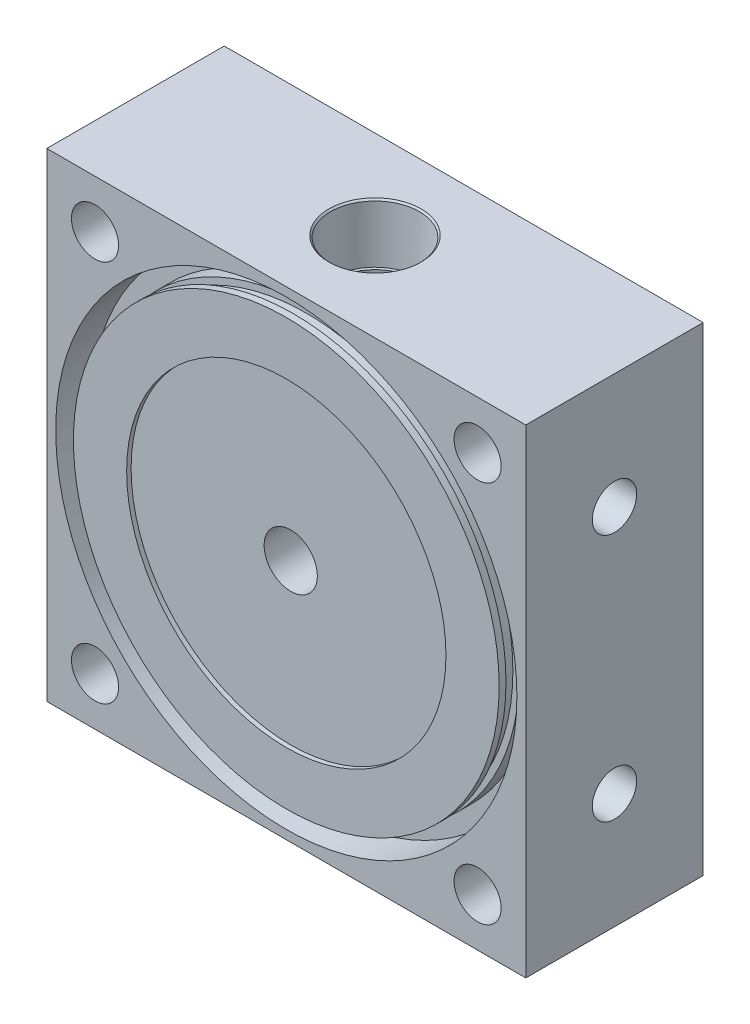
from build123d import *

# Parameters (mm, degrees)
SKETCH1_W                        = 85.725
SKETCH1_H                        = 85.725
EXTRUDE1_DEPTH                   = 31.75
SKETCH2_R                        = 41.275
SKETCH2_R_2                      = 38.1
CUT_EXTRUDE1_DEPTH               = 6.35
F_5_16_CLEARANCE_HOLE1_D         = 8.4328
F_3_8_0_375_DIAMETER_HOLE1_D     = 9.525
F_3_8_0_375_DIAMETER_HOLE1_DEPTH = 15.875
F_3_8_0_375_DIAMETER_HOLE1_TIP   = 2.861598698
SKETCH9_R                        = 28.575
CUT_EXTRUDE3_DEPTH               = 0.79375
SKETCH10_W                       = 2.38125
SKETCH10_H                       = 1.143
F_3_8_16_TAPPED_HOLE1_D          = 7.9375
F_3_8_16_TAPPED_HOLE1_DEPTH      = 26.9875
F_3_8_16_TAPPED_HOLE1_TIP        = 2.384665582


with BuildPart() as part:
    # Sketch1 → Extrude1 (new body)
    with BuildSketch(Plane.XY):
        Rectangle(SKETCH1_W, SKETCH1_H)
    extrude(amount=EXTRUDE1_DEPTH)

    # Sketch2 → Cut-Extrude1 (cut)
    with BuildSketch(Plane.XY.offset(31.75)):
        Circle(SKETCH2_R)
        Circle(SKETCH2_R_2, mode=Mode.SUBTRACT)
    extrude(amount=-CUT_EXTRUDE1_DEPTH, mode=Mode.SUBTRACT)

    # 5_16 Clearance Hole1 (through all)
    with Locations(Plane.XY.offset(31.75)):
        with Locations((-34.237226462, 34.237226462), (34.237226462, 34.237226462), (34.237226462, -34.237226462), (-34.237226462, -34.237226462)):
            Hole(F_5_16_CLEARANCE_HOLE1_D / 2)

    # Sketch4 → 3_8 NPT Tapped Hole1 (revolve, cut)
    with BuildSketch(Plane(origin=(0, 42.8625, 15.875), x_dir=(0, 0, 1), z_dir=(1, 0, 0))):
        Polygon((0, 0), (0, 21.687582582), (7.1374, 17.399), (7.1374, 10.3378), (7.664680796, 10.3378), (7.9655416, 0.2894584), (8.255, 0), align=None)
    revolve(axis=Axis((0, 49.2125, 15.875), (0, -1, 0)), mode=Mode.SUBTRACT)

    # 3_8 _0.375_ Diameter Hole1
    with Locations(Plane.XY.offset(31.75)):
        with Locations((0, 0)):
            Hole(F_3_8_0_375_DIAMETER_HOLE1_D / 2, depth=F_3_8_0_375_DIAMETER_HOLE1_DEPTH)
            with Locations((0, 0, -(F_3_8_0_375_DIAMETER_HOLE1_DEPTH + F_3_8_0_375_DIAMETER_HOLE1_TIP / 2))):  # 118° drill point
                Cone(0, F_3_8_0_375_DIAMETER_HOLE1_D / 2, F_3_8_0_375_DIAMETER_HOLE1_TIP, mode=Mode.SUBTRACT)

    # Sketch9 → Cut-Extrude3 (cut)
    with BuildSketch(Plane.XY.offset(31.75)):
        Circle(SKETCH9_R)
    extrude(amount=-CUT_EXTRUDE3_DEPTH, mode=Mode.SUBTRACT)

    # Sketch10 → Cut-Revolve1 (revolve, cut)
    with BuildSketch(Plane(origin=(0, 0, 0), x_dir=(0, 0, -1), z_dir=(1, 0, 0)), mode=Mode.PRIVATE) as cut_revolve1_sk:
        with Locations((-29.340175, 37.5285)):
            Rectangle(SKETCH10_W, SKETCH10_H)
    revolve(cut_revolve1_sk.sketch.rotate(Axis((0, 0, 0), (0, 0, 1)), 270), axis=Axis((0, 0, 0), (0, 0, 1)), mode=Mode.SUBTRACT)

    # Sketch14 → Cut-Revolve2 (revolve, cut)
    with BuildSketch(Plane(origin=(0, 0, 0), x_dir=(0, 0, -1), z_dir=(1, 0, 0))):
        Polygon((-15.875, 42.8625), (-10.7156758, 42.8625), (-10.7156758, -15.875), (-11.90625, -15.875), (-11.90625, -16.69161), (-12.7, -18.393812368), (-12.7, -42.8625), (-15.875, -42.8625), align=None)
    revolve(axis=Axis((0, 42.8625, 15.875), (0, 1, 0)), mode=Mode.SUBTRACT)

    # 3_8-16 Tapped Hole1
    with Locations(Plane(origin=(42.8625, 0, 0), x_dir=(0, 0, -1), z_dir=(1, 0, 0))):
        with Locations((-15.875, 22.225), (-15.875, -22.225)):
            Hole(F_3_8_16_TAPPED_HOLE1_D / 2, depth=F_3_8_16_TAPPED_HOLE1_DEPTH)
            with Locations((0, 0, -(F_3_8_16_TAPPED_HOLE1_DEPTH + F_3_8_16_TAPPED_HOLE1_TIP / 2))):  # 118° drill point
                Cone(0, F_3_8_16_TAPPED_HOLE1_D / 2, F_3_8_16_TAPPED_HOLE1_TIP, mode=Mode.SUBTRACT)


solid = part.part
